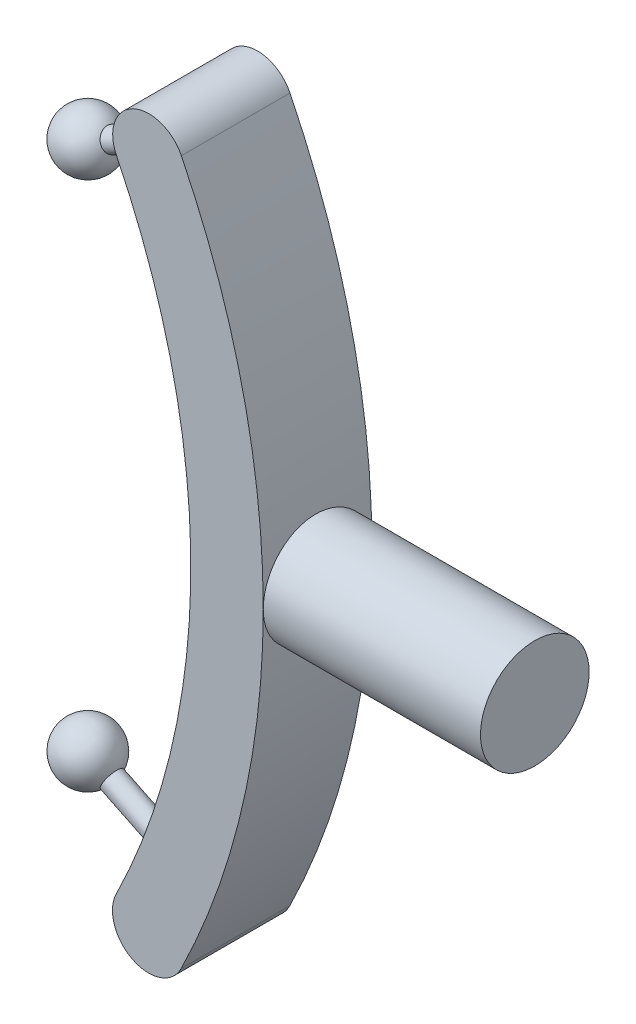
ISO-10303-21;
HEADER;
FILE_DESCRIPTION(('STEP AP214'),'2;1');
FILE_NAME('part.step','',(''),(''),'','','');
FILE_SCHEMA(('AUTOMOTIVE_DESIGN { 1 0 10303 214 1 1 1 1 }'));
ENDSEC;
DATA;
#1=APPLICATION_CONTEXT('core data for automotive mechanical design processes');
#2=APPLICATION_PROTOCOL_DEFINITION('international standard','automotive_design',2000,#1);
#3=PRODUCT_CONTEXT('',#1,'mechanical');
#4=PRODUCT('Part','Part','',(#3));
#5=PRODUCT_RELATED_PRODUCT_CATEGORY('part','',(#4));
#6=PRODUCT_DEFINITION_FORMATION('','',#4);
#7=PRODUCT_DEFINITION_CONTEXT('part definition',#1,'design');
#8=PRODUCT_DEFINITION('design','',#6,#7);
#9=PRODUCT_DEFINITION_SHAPE('','',#8);
#10=(LENGTH_UNIT() NAMED_UNIT(*) SI_UNIT(.MILLI.,.METRE.));
#11=(NAMED_UNIT(*) PLANE_ANGLE_UNIT() SI_UNIT($,.RADIAN.));
#12=(NAMED_UNIT(*) SI_UNIT($,.STERADIAN.) SOLID_ANGLE_UNIT());
#13=UNCERTAINTY_MEASURE_WITH_UNIT(LENGTH_MEASURE(1.E-05),#10,'distance_accuracy_value','');
#14=(GEOMETRIC_REPRESENTATION_CONTEXT(3) GLOBAL_UNCERTAINTY_ASSIGNED_CONTEXT((#13)) GLOBAL_UNIT_ASSIGNED_CONTEXT((#10,
#11,#12)) REPRESENTATION_CONTEXT('',''));
#15=CARTESIAN_POINT('',(0.,0.,0.));
#16=DIRECTION('',(0.,0.,1.));
#17=DIRECTION('',(1.,0.,0.));
#18=AXIS2_PLACEMENT_3D('',#15,#16,#17);
#19=CARTESIAN_POINT('',(120.643673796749,-56.8344794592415,0.));
#20=DIRECTION('',(0.898930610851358,-0.438091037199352,0.));
#21=DIRECTION('',(-0.438091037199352,-0.898930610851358,0.));
#22=AXIS2_PLACEMENT_3D('',#19,#20,#21);
#23=CYLINDRICAL_SURFACE('',#22,1.90500000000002);
#24=CARTESIAN_POINT('',(114.101757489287,-55.7654815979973,0.));
#25=CARTESIAN_POINT('',(114.101759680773,-55.7654773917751,-0.107004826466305));
#26=CARTESIAN_POINT('',(114.105730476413,-55.7573547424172,-0.21408708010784));
#27=CARTESIAN_POINT('',(114.121505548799,-55.7250597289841,-0.425302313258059));
#28=CARTESIAN_POINT('',(114.133319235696,-55.7008680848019,-0.529431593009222));
#29=CARTESIAN_POINT('',(114.164413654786,-55.6371090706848,-0.731650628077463));
#30=CARTESIAN_POINT('',(114.183690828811,-55.5975490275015,-0.829743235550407));
#31=CARTESIAN_POINT('',(114.229114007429,-55.5041637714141,-1.01712055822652));
#32=CARTESIAN_POINT('',(114.255258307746,-55.4503420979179,-1.10640745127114));
#33=CARTESIAN_POINT('',(114.313621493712,-55.3299232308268,-1.27367881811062));
#34=CARTESIAN_POINT('',(114.345840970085,-55.2633247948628,-1.35166219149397));
#35=CARTESIAN_POINT('',(114.415377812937,-55.1192135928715,-1.49410413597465));
#36=CARTESIAN_POINT('',(114.452695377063,-55.0417004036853,-1.55856218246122));
#37=CARTESIAN_POINT('',(114.53130610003,-54.8779387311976,-1.67211672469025));
#38=CARTESIAN_POINT('',(114.572599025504,-54.7916907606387,-1.72121412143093));
#39=CARTESIAN_POINT('',(114.657939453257,-54.6128805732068,-1.80265913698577));
#40=CARTESIAN_POINT('',(114.701986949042,-54.5203183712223,-1.83500679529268));
#41=CARTESIAN_POINT('',(114.791549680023,-54.3314921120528,-1.88203504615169));
#42=CARTESIAN_POINT('',(114.837064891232,-54.235228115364,-1.89671592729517));
#43=CARTESIAN_POINT('',(114.928254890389,-54.0417215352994,-1.90799662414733));
#44=CARTESIAN_POINT('',(114.973929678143,-53.9444789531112,-1.9045964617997));
#45=CARTESIAN_POINT('',(115.064151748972,-53.7517656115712,-1.87981215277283));
#46=CARTESIAN_POINT('',(115.10869890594,-53.6562950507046,-1.85842600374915));
#47=CARTESIAN_POINT('',(115.195420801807,-53.4698569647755,-1.79827551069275));
#48=CARTESIAN_POINT('',(115.237595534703,-53.3788894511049,-1.75951112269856));
#49=CARTESIAN_POINT('',(115.318426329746,-53.2040396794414,-1.66569485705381));
#50=CARTESIAN_POINT('',(115.357081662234,-53.1201588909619,-1.61063961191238));
#51=CARTESIAN_POINT('',(115.429821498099,-52.9619099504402,-1.4858065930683));
#52=CARTESIAN_POINT('',(115.463905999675,-52.887541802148,-1.41602881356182));
#53=CARTESIAN_POINT('',(115.5266001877,-52.7504534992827,-1.26372400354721));
#54=CARTESIAN_POINT('',(115.555209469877,-52.6877342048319,-1.18119603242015));
#55=CARTESIAN_POINT('',(115.60619820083,-52.5757618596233,-1.0057359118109));
#56=CARTESIAN_POINT('',(115.628577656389,-52.526508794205,-0.912803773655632));
#57=CARTESIAN_POINT('',(115.666519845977,-52.4429051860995,-0.719195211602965));
#58=CARTESIAN_POINT('',(115.682084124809,-52.4085512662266,-0.618520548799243));
#59=CARTESIAN_POINT('',(115.706001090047,-52.35572709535,-0.412266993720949));
#60=CARTESIAN_POINT('',(115.714353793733,-52.3372568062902,-0.306688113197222));
#61=CARTESIAN_POINT('',(115.72363101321,-52.3167406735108,-0.0936641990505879));
#62=CARTESIAN_POINT('',(115.724558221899,-52.3146888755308,0.013780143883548));
#63=CARTESIAN_POINT('',(115.718967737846,-52.3270537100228,0.227521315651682));
#64=CARTESIAN_POINT('',(115.712450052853,-52.3414703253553,0.333818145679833));
#65=CARTESIAN_POINT('',(115.692138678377,-52.3863498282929,0.542232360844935));
#66=CARTESIAN_POINT('',(115.678345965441,-52.4168105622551,0.644350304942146));
#67=CARTESIAN_POINT('',(115.643840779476,-52.4928930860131,0.841525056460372));
#68=CARTESIAN_POINT('',(115.623128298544,-52.5385148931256,0.936581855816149));
#69=CARTESIAN_POINT('',(115.575315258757,-52.6436114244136,1.1169609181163));
#70=CARTESIAN_POINT('',(115.548213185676,-52.7030894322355,1.20228086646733));
#71=CARTESIAN_POINT('',(115.488333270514,-52.8341750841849,1.36074191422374));
#72=CARTESIAN_POINT('',(115.455555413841,-52.9057827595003,1.43388298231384));
#73=CARTESIAN_POINT('',(115.385179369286,-53.0590942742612,1.56593718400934));
#74=CARTESIAN_POINT('',(115.347579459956,-53.1408017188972,1.62484521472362));
#75=CARTESIAN_POINT('',(115.268578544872,-53.311946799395,1.72672848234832));
#76=CARTESIAN_POINT('',(115.227177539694,-53.4013844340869,1.76970372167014));
#77=CARTESIAN_POINT('',(115.141697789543,-53.5854431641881,1.83850611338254));
#78=CARTESIAN_POINT('',(115.097618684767,-53.6800649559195,1.86433095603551));
#79=CARTESIAN_POINT('',(115.008010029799,-53.8717813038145,1.89808862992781));
#80=CARTESIAN_POINT('',(114.962480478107,-53.9688758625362,1.90602144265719));
#81=CARTESIAN_POINT('',(114.871261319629,-54.1627621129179,1.90376800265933));
#82=CARTESIAN_POINT('',(114.825571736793,-54.2595538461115,1.89358435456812));
#83=CARTESIAN_POINT('',(114.735335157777,-54.4501054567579,1.85539035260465));
#84=CARTESIAN_POINT('',(114.690788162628,-54.5438653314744,1.82737998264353));
#85=CARTESIAN_POINT('',(114.60414106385,-54.7256886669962,1.75433326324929));
#86=CARTESIAN_POINT('',(114.562040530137,-54.8137531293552,1.70929991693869));
#87=CARTESIAN_POINT('',(114.481522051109,-54.9817223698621,1.60348647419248));
#88=CARTESIAN_POINT('',(114.44310396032,-55.0616274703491,1.54270700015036));
#89=CARTESIAN_POINT('',(114.371103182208,-55.2110282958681,1.407138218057));
#90=CARTESIAN_POINT('',(114.337519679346,-55.2805257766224,1.33235127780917));
#91=CARTESIAN_POINT('',(114.276187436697,-55.4072012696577,1.17085931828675));
#92=CARTESIAN_POINT('',(114.248440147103,-55.4643762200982,1.0841513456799));
#93=CARTESIAN_POINT('',(114.199625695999,-55.5648145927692,0.901260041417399));
#94=CARTESIAN_POINT('',(114.178561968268,-55.6080708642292,0.805071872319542));
#95=CARTESIAN_POINT('',(114.143800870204,-55.6793885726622,0.606058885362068));
#96=CARTESIAN_POINT('',(114.13009468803,-55.7074681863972,0.503242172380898));
#97=CARTESIAN_POINT('',(114.11411968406,-55.7401818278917,0.333143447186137));
#98=CARTESIAN_POINT('',(114.109490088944,-55.7496575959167,0.266965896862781));
#99=CARTESIAN_POINT('',(114.103308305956,-55.7623087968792,0.133869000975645));
#100=CARTESIAN_POINT('',(114.101756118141,-55.7654842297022,0.0669496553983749));
#101=CARTESIAN_POINT('',(114.101757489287,-55.7654815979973,0.));
#102=B_SPLINE_CURVE_WITH_KNOTS('',3,(#24,#25,#26,#27,#28,#29,#30,#31,#32,#33,#34,#35,#36,#37,
#38,#39,#40,#41,#42,#43,#44,#45,#46,#47,#48,#49,#50,#51,#52,#53,#54,#55,#56,#57,#58,#59,#60,#61,
#62,#63,#64,#65,#66,#67,#68,#69,#70,#71,#72,#73,#74,#75,#76,#77,#78,#79,#80,#81,#82,#83,#84,#85,
#86,#87,#88,#89,#90,#91,#92,#93,#94,#95,#96,#97,#98,#99,#100,#101),.UNSPECIFIED.,.T.,.F.,(4,2,2,
2,2,2,2,2,2,2,2,2,2,2,2,2,2,2,2,2,2,2,2,2,2,2,2,2,2,2,2,2,2,2,2,2,2,2,4),(0.,0.320770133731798,
0.641925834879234,0.962928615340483,1.28385180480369,1.60480621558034,1.92577307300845,
2.24672110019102,2.56766837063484,2.88861039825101,3.20955203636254,3.53052940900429,
3.85150759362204,4.17255217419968,4.49359688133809,4.81466528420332,5.13573333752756,
5.45672857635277,5.77772304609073,6.09860110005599,6.41947882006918,6.74031347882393,
7.06114850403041,7.38205963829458,7.70297159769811,8.02399844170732,8.34502523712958,
8.66609525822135,8.98716561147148,9.30818980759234,9.62921429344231,9.95018217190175,
10.2711373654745,10.5920383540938,10.913018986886,11.2341642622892,11.554924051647,
11.7556201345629,11.9563162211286),.UNSPECIFIED.);
#103=CARTESIAN_POINT('',(114.101757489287,-55.7654815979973,0.));
#104=VERTEX_POINT('',#103);
#105=EDGE_CURVE('E177',#104,#104,#102,.T.);
#106=ORIENTED_EDGE('',*,*,#105,.F.);
#107=EDGE_LOOP('',(#106));
#108=FACE_BOUND('',#107,.T.);
#109=CARTESIAN_POINT('',(103.642456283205,-48.5489889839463,0.));
#110=DIRECTION('',(-0.898930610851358,0.438091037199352,0.));
#111=DIRECTION('',(-0.438091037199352,-0.898930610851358,0.));
#112=AXIS2_PLACEMENT_3D('',#109,#110,#111);
#113=CIRCLE('',#112,1.90500000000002);
#114=CARTESIAN_POINT('',(102.80789285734,-50.2614517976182,0.));
#115=VERTEX_POINT('',#114);
#116=EDGE_CURVE('E36',#115,#115,#113,.F.);
#117=ORIENTED_EDGE('',*,*,#116,.T.);
#118=EDGE_LOOP('',(#117));
#119=FACE_BOUND('',#118,.T.);
#120=ADVANCED_FACE('F32',(#108,#119),#23,.T.);
#121=CARTESIAN_POINT('',(120.643673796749,56.8344794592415,0.));
#122=DIRECTION('',(0.898930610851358,0.438091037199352,0.));
#123=DIRECTION('',(-0.438091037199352,0.898930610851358,0.));
#124=AXIS2_PLACEMENT_3D('',#121,#122,#123);
#125=CYLINDRICAL_SURFACE('',#124,1.90500000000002);
#126=CARTESIAN_POINT('',(114.101757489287,55.7654815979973,0.));
#127=CARTESIAN_POINT('',(114.101759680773,55.7654773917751,0.107004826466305));
#128=CARTESIAN_POINT('',(114.105730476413,55.7573547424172,0.21408708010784));
#129=CARTESIAN_POINT('',(114.121505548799,55.7250597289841,0.425302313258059));
#130=CARTESIAN_POINT('',(114.133319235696,55.7008680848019,0.529431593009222));
#131=CARTESIAN_POINT('',(114.164413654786,55.6371090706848,0.731650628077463));
#132=CARTESIAN_POINT('',(114.183690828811,55.5975490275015,0.829743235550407));
#133=CARTESIAN_POINT('',(114.229114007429,55.5041637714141,1.01712055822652));
#134=CARTESIAN_POINT('',(114.255258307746,55.4503420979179,1.10640745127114));
#135=CARTESIAN_POINT('',(114.313621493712,55.3299232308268,1.27367881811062));
#136=CARTESIAN_POINT('',(114.345840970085,55.2633247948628,1.35166219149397));
#137=CARTESIAN_POINT('',(114.415377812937,55.1192135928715,1.49410413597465));
#138=CARTESIAN_POINT('',(114.452695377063,55.0417004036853,1.55856218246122));
#139=CARTESIAN_POINT('',(114.53130610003,54.8779387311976,1.67211672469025));
#140=CARTESIAN_POINT('',(114.572599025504,54.7916907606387,1.72121412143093));
#141=CARTESIAN_POINT('',(114.657939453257,54.6128805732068,1.80265913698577));
#142=CARTESIAN_POINT('',(114.701986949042,54.5203183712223,1.83500679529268));
#143=CARTESIAN_POINT('',(114.791549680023,54.3314921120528,1.88203504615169));
#144=CARTESIAN_POINT('',(114.837064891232,54.235228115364,1.89671592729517));
#145=CARTESIAN_POINT('',(114.928254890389,54.0417215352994,1.90799662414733));
#146=CARTESIAN_POINT('',(114.973929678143,53.9444789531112,1.9045964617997));
#147=CARTESIAN_POINT('',(115.064151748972,53.7517656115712,1.87981215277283));
#148=CARTESIAN_POINT('',(115.10869890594,53.6562950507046,1.85842600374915));
#149=CARTESIAN_POINT('',(115.195420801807,53.4698569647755,1.79827551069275));
#150=CARTESIAN_POINT('',(115.237595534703,53.3788894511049,1.75951112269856));
#151=CARTESIAN_POINT('',(115.318426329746,53.2040396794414,1.66569485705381));
#152=CARTESIAN_POINT('',(115.357081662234,53.1201588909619,1.61063961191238));
#153=CARTESIAN_POINT('',(115.429821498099,52.9619099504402,1.4858065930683));
#154=CARTESIAN_POINT('',(115.463905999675,52.887541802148,1.41602881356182));
#155=CARTESIAN_POINT('',(115.5266001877,52.7504534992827,1.26372400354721));
#156=CARTESIAN_POINT('',(115.555209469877,52.6877342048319,1.18119603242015));
#157=CARTESIAN_POINT('',(115.60619820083,52.5757618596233,1.0057359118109));
#158=CARTESIAN_POINT('',(115.628577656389,52.526508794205,0.912803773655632));
#159=CARTESIAN_POINT('',(115.666519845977,52.4429051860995,0.719195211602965));
#160=CARTESIAN_POINT('',(115.682084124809,52.4085512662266,0.618520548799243));
#161=CARTESIAN_POINT('',(115.706001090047,52.35572709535,0.412266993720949));
#162=CARTESIAN_POINT('',(115.714353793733,52.3372568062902,0.306688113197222));
#163=CARTESIAN_POINT('',(115.72363101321,52.3167406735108,0.0936641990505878));
#164=CARTESIAN_POINT('',(115.724558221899,52.3146888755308,-0.013780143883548));
#165=CARTESIAN_POINT('',(115.718967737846,52.3270537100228,-0.227521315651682));
#166=CARTESIAN_POINT('',(115.712450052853,52.3414703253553,-0.333818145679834));
#167=CARTESIAN_POINT('',(115.692138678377,52.3863498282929,-0.542232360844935));
#168=CARTESIAN_POINT('',(115.678345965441,52.4168105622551,-0.644350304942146));
#169=CARTESIAN_POINT('',(115.643840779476,52.4928930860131,-0.841525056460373));
#170=CARTESIAN_POINT('',(115.623128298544,52.5385148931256,-0.936581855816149));
#171=CARTESIAN_POINT('',(115.575315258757,52.6436114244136,-1.1169609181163));
#172=CARTESIAN_POINT('',(115.548213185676,52.7030894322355,-1.20228086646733));
#173=CARTESIAN_POINT('',(115.488333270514,52.8341750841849,-1.36074191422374));
#174=CARTESIAN_POINT('',(115.455555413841,52.9057827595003,-1.43388298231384));
#175=CARTESIAN_POINT('',(115.385179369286,53.0590942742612,-1.56593718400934));
#176=CARTESIAN_POINT('',(115.347579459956,53.1408017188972,-1.62484521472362));
#177=CARTESIAN_POINT('',(115.268578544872,53.311946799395,-1.72672848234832));
#178=CARTESIAN_POINT('',(115.227177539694,53.4013844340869,-1.76970372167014));
#179=CARTESIAN_POINT('',(115.141697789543,53.5854431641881,-1.83850611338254));
#180=CARTESIAN_POINT('',(115.097618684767,53.6800649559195,-1.86433095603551));
#181=CARTESIAN_POINT('',(115.008010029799,53.8717813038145,-1.89808862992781));
#182=CARTESIAN_POINT('',(114.962480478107,53.9688758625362,-1.90602144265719));
#183=CARTESIAN_POINT('',(114.871261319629,54.1627621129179,-1.90376800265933));
#184=CARTESIAN_POINT('',(114.825571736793,54.2595538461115,-1.89358435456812));
#185=CARTESIAN_POINT('',(114.735335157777,54.4501054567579,-1.85539035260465));
#186=CARTESIAN_POINT('',(114.690788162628,54.5438653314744,-1.82737998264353));
#187=CARTESIAN_POINT('',(114.60414106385,54.7256886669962,-1.75433326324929));
#188=CARTESIAN_POINT('',(114.562040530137,54.8137531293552,-1.70929991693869));
#189=CARTESIAN_POINT('',(114.481522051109,54.9817223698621,-1.60348647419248));
#190=CARTESIAN_POINT('',(114.44310396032,55.0616274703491,-1.54270700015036));
#191=CARTESIAN_POINT('',(114.371103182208,55.2110282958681,-1.407138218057));
#192=CARTESIAN_POINT('',(114.337519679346,55.2805257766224,-1.33235127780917));
#193=CARTESIAN_POINT('',(114.276187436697,55.4072012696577,-1.17085931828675));
#194=CARTESIAN_POINT('',(114.248440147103,55.4643762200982,-1.0841513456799));
#195=CARTESIAN_POINT('',(114.199625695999,55.5648145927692,-0.901260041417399));
#196=CARTESIAN_POINT('',(114.178561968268,55.6080708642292,-0.805071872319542));
#197=CARTESIAN_POINT('',(114.143800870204,55.6793885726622,-0.606058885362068));
#198=CARTESIAN_POINT('',(114.13009468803,55.7074681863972,-0.503242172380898));
#199=CARTESIAN_POINT('',(114.11411968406,55.7401818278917,-0.333143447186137));
#200=CARTESIAN_POINT('',(114.109490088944,55.7496575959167,-0.266965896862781));
#201=CARTESIAN_POINT('',(114.103308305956,55.7623087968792,-0.133869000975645));
#202=CARTESIAN_POINT('',(114.101756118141,55.7654842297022,-0.0669496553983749));
#203=CARTESIAN_POINT('',(114.101757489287,55.7654815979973,0.));
#204=B_SPLINE_CURVE_WITH_KNOTS('',3,(#126,#127,#128,#129,#130,#131,#132,#133,#134,#135,#136,
#137,#138,#139,#140,#141,#142,#143,#144,#145,#146,#147,#148,#149,#150,#151,#152,#153,#154,#155,
#156,#157,#158,#159,#160,#161,#162,#163,#164,#165,#166,#167,#168,#169,#170,#171,#172,#173,#174,
#175,#176,#177,#178,#179,#180,#181,#182,#183,#184,#185,#186,#187,#188,#189,#190,#191,#192,#193,
#194,#195,#196,#197,#198,#199,#200,#201,#202,#203),.UNSPECIFIED.,.T.,.F.,(4,2,2,2,2,2,2,2,2,2,2,
2,2,2,2,2,2,2,2,2,2,2,2,2,2,2,2,2,2,2,2,2,2,2,2,2,2,2,4),(0.,0.320770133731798,
0.641925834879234,0.962928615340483,1.28385180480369,1.60480621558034,1.92577307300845,
2.24672110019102,2.56766837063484,2.88861039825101,3.20955203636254,3.53052940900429,
3.85150759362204,4.17255217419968,4.49359688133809,4.81466528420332,5.13573333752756,
5.45672857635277,5.77772304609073,6.09860110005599,6.41947882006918,6.74031347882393,
7.06114850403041,7.38205963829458,7.70297159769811,8.02399844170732,8.34502523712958,
8.66609525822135,8.98716561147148,9.30818980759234,9.62921429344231,9.95018217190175,
10.2711373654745,10.5920383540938,10.913018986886,11.2341642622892,11.554924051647,
11.7556201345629,11.9563162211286),.UNSPECIFIED.);
#205=CARTESIAN_POINT('',(114.101757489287,55.7654815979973,0.));
#206=VERTEX_POINT('',#205);
#207=EDGE_CURVE('E125',#206,#206,#204,.T.);
#208=ORIENTED_EDGE('',*,*,#207,.F.);
#209=EDGE_LOOP('',(#208));
#210=FACE_BOUND('',#209,.T.);
#211=CARTESIAN_POINT('',(103.642456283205,48.5489889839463,0.));
#212=DIRECTION('',(-0.898930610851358,-0.438091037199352,0.));
#213=DIRECTION('',(0.438091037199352,-0.898930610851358,0.));
#214=AXIS2_PLACEMENT_3D('',#211,#212,#213);
#215=CIRCLE('',#214,1.90500000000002);
#216=CARTESIAN_POINT('',(104.477019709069,46.8365261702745,0.));
#217=VERTEX_POINT('',#216);
#218=EDGE_CURVE('E133',#217,#217,#215,.F.);
#219=ORIENTED_EDGE('',*,*,#218,.T.);
#220=EDGE_LOOP('',(#219));
#221=FACE_BOUND('',#220,.T.);
#222=ADVANCED_FACE('F138',(#210,#221),#125,.T.);
#223=CARTESIAN_POINT('',(5.32907051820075E-12,2.66453525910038E-12,9.525));
#224=DIRECTION('',(0.,0.,-1.));
#225=DIRECTION('',(-1.,0.,0.));
#226=AXIS2_PLACEMENT_3D('',#223,#224,#225);
#227=CYLINDRICAL_SURFACE('',#226,139.7);
#228=CARTESIAN_POINT('',(5.32907051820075E-12,2.66453525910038E-12,-9.525));
#229=DIRECTION('',(0.,0.,1.));
#230=DIRECTION('',(1.,0.,0.));
#231=AXIS2_PLACEMENT_3D('',#228,#229,#230);
#232=CIRCLE('',#231,139.7);
#233=CARTESIAN_POINT('',(125.300313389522,-61.7731451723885,-9.525));
#234=VERTEX_POINT('',#233);
#235=CARTESIAN_POINT('',(139.700000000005,0.,-9.525));
#236=VERTEX_POINT('',#235);
#237=EDGE_CURVE('E96',#234,#236,#232,.T.);
#238=ORIENTED_EDGE('',*,*,#237,.T.);
#239=CARTESIAN_POINT('',(139.700000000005,0.,-9.52500000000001));
#240=CARTESIAN_POINT('',(139.700000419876,-0.26727418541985,-9.52500223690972));
#241=CARTESIAN_POINT('',(139.699231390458,-0.534512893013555,-9.51374586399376));
#242=CARTESIAN_POINT('',(139.696177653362,-1.0671753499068,-9.46880124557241));
#243=CARTESIAN_POINT('',(139.693892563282,-1.33259862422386,-9.4351073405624));
#244=CARTESIAN_POINT('',(139.68786744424,-1.85992001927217,-9.34547637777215));
#245=CARTESIAN_POINT('',(139.68412593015,-2.12181425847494,-9.28951661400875));
#246=CARTESIAN_POINT('',(139.675294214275,-2.63994766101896,-9.15575712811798));
#247=CARTESIAN_POINT('',(139.670203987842,-2.89618672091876,-9.07795700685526));
#248=CARTESIAN_POINT('',(139.658822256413,-3.40104262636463,-8.90112535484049));
#249=CARTESIAN_POINT('',(139.652531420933,-3.64966363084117,-8.8021056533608));
#250=CARTESIAN_POINT('',(139.638924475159,-4.13767631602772,-8.58351589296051));
#251=CARTESIAN_POINT('',(139.631608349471,-4.37706785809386,-8.46394552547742));
#252=CARTESIAN_POINT('',(139.616159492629,-4.84487094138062,-8.20513797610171));
#253=CARTESIAN_POINT('',(139.608026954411,-5.0732850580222,-8.06590543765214));
#254=CARTESIAN_POINT('',(139.591173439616,-5.51758361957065,-7.76874014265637));
#255=CARTESIAN_POINT('',(139.582452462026,-5.73346804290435,-7.61080735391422));
#256=CARTESIAN_POINT('',(139.564654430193,-6.15151045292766,-7.27710003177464));
#257=CARTESIAN_POINT('',(139.555576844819,-6.35364663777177,-7.10129821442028));
#258=CARTESIAN_POINT('',(139.537335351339,-6.74239711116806,-6.73330109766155));
#259=CARTESIAN_POINT('',(139.528171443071,-6.92901137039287,-6.54110576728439));
#260=CARTESIAN_POINT('',(139.510016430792,-7.28540766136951,-6.14166962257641));
#261=CARTESIAN_POINT('',(139.501025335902,-7.45518880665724,-5.93442801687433));
#262=CARTESIAN_POINT('',(139.483471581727,-7.77670141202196,-5.50637704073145));
#263=CARTESIAN_POINT('',(139.474908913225,-7.92843326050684,-5.28556796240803));
#264=CARTESIAN_POINT('',(139.458446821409,-8.21291298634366,-4.83171632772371));
#265=CARTESIAN_POINT('',(139.450548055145,-8.34564214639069,-4.59866201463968));
#266=CARTESIAN_POINT('',(139.435648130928,-8.59099201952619,-4.12217069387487));
#267=CARTESIAN_POINT('',(139.428646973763,-8.70361271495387,-3.87873367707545));
#268=CARTESIAN_POINT('',(139.41574208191,-8.90793725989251,-3.38320872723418));
#269=CARTESIAN_POINT('',(139.409838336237,-8.99964131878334,-3.13112088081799));
#270=CARTESIAN_POINT('',(139.399296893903,-9.16147407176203,-2.62008662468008));
#271=CARTESIAN_POINT('',(139.394659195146,-9.23160280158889,-2.36114022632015));
#272=CARTESIAN_POINT('',(139.386788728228,-9.34968600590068,-1.8386462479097));
#273=CARTESIAN_POINT('',(139.383553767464,-9.39767509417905,-1.57510652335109));
#274=CARTESIAN_POINT('',(139.378570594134,-9.47129470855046,-1.04490847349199));
#275=CARTESIAN_POINT('',(139.376822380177,-9.49692525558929,-0.778250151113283));
#276=CARTESIAN_POINT('',(139.374862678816,-9.52564232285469,-0.24371986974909));
#277=CARTESIAN_POINT('',(139.374651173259,-9.52872910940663,0.0241520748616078));
#278=CARTESIAN_POINT('',(139.375770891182,-9.51233700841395,0.559201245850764));
#279=CARTESIAN_POINT('',(139.377102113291,-9.49285814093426,0.82637847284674));
#280=CARTESIAN_POINT('',(139.381265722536,-9.43152722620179,1.35768624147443));
#281=CARTESIAN_POINT('',(139.384095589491,-9.3897127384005,1.6218211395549));
#282=CARTESIAN_POINT('',(139.39117435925,-9.28403527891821,2.14562295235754));
#283=CARTESIAN_POINT('',(139.395423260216,-9.22017233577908,2.40528987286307));
#284=CARTESIAN_POINT('',(139.405219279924,-9.07085605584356,2.91831608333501));
#285=CARTESIAN_POINT('',(139.410766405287,-8.98540260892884,3.17167534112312));
#286=CARTESIAN_POINT('',(139.423001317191,-8.79351686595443,3.67029238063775));
#287=CARTESIAN_POINT('',(139.429689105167,-8.68708454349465,3.91555015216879));
#288=CARTESIAN_POINT('',(139.444020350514,-8.45392401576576,4.39638858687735));
#289=CARTESIAN_POINT('',(139.451664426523,-8.32718265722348,4.63196285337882));
#290=CARTESIAN_POINT('',(139.467691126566,-8.05430377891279,5.09168883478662));
#291=CARTESIAN_POINT('',(139.476074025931,-7.90815901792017,5.31583624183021));
#292=CARTESIAN_POINT('',(139.493334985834,-7.59760880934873,5.75094577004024));
#293=CARTESIAN_POINT('',(139.502212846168,-7.43321071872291,5.96191315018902));
#294=CARTESIAN_POINT('',(139.520219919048,-7.0871891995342,6.36936765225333));
#295=CARTESIAN_POINT('',(139.529349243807,-6.90555798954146,6.56584816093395));
#296=CARTESIAN_POINT('',(139.547616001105,-6.5260267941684,6.94322399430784));
#297=CARTESIAN_POINT('',(139.556753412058,-6.32809430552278,7.12408663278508));
#298=CARTESIAN_POINT('',(139.574754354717,-5.91777732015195,7.46841583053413));
#299=CARTESIAN_POINT('',(139.583618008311,-5.70539939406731,7.63189021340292));
#300=CARTESIAN_POINT('',(139.600828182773,-5.26752205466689,7.94044085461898));
#301=CARTESIAN_POINT('',(139.609174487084,-5.04201722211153,8.08550943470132));
#302=CARTESIAN_POINT('',(139.625106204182,-4.5796503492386,8.356084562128));
#303=CARTESIAN_POINT('',(139.632691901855,-4.34279261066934,8.4815984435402));
#304=CARTESIAN_POINT('',(139.646892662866,-3.85925867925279,8.71226251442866));
#305=CARTESIAN_POINT('',(139.653507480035,-3.61258001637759,8.81740754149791));
#306=CARTESIAN_POINT('',(139.665576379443,-3.11121295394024,9.00654005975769));
#307=CARTESIAN_POINT('',(139.671030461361,-2.85652455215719,9.09052754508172));
#308=CARTESIAN_POINT('',(139.680622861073,-2.34095426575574,9.23673940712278));
#309=CARTESIAN_POINT('',(139.684761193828,-2.0800724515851,9.29896403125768));
#310=CARTESIAN_POINT('',(139.691604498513,-1.55397385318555,9.40120194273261));
#311=CARTESIAN_POINT('',(139.694309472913,-1.28875707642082,9.44121526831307));
#312=CARTESIAN_POINT('',(139.69820520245,-0.756418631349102,9.49868326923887));
#313=CARTESIAN_POINT('',(139.699398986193,-0.489301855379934,9.51618306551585));
#314=CARTESIAN_POINT('',(139.700248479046,0.0454591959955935,9.52864572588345));
#315=CARTESIAN_POINT('',(139.699904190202,0.313103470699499,9.52360861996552));
#316=CARTESIAN_POINT('',(139.697687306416,0.847011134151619,9.49103400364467));
#317=CARTESIAN_POINT('',(139.695814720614,1.11327453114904,9.46349662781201));
#318=CARTESIAN_POINT('',(139.690594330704,1.64252615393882,9.38612041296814));
#319=CARTESIAN_POINT('',(139.687246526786,1.9055143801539,9.3362815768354));
#320=CARTESIAN_POINT('',(139.679174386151,2.42609806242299,9.21471930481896));
#321=CARTESIAN_POINT('',(139.674451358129,2.68369839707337,9.14301667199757));
#322=CARTESIAN_POINT('',(139.66376102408,3.19193800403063,8.97822492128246));
#323=CARTESIAN_POINT('',(139.657793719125,3.4425772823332,8.88513582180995));
#324=CARTESIAN_POINT('',(139.644784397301,3.93508207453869,8.67825344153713));
#325=CARTESIAN_POINT('',(139.637742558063,4.17694903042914,8.56446358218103));
#326=CARTESIAN_POINT('',(139.62277945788,4.65032933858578,8.31693614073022));
#327=CARTESIAN_POINT('',(139.614857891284,4.88183905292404,8.1831916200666));
#328=CARTESIAN_POINT('',(139.598349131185,5.33310217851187,7.8965308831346));
#329=CARTESIAN_POINT('',(139.589761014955,5.552838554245,7.74358790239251));
#330=CARTESIAN_POINT('',(139.572171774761,5.97865229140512,7.41976327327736));
#331=CARTESIAN_POINT('',(139.56317065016,6.18472963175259,7.24888159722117));
#332=CARTESIAN_POINT('',(139.54500823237,6.58180792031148,6.89035526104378));
#333=CARTESIAN_POINT('',(139.535846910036,6.77280608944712,6.70270752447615));
#334=CARTESIAN_POINT('',(139.517628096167,7.13827176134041,6.31206919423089));
#335=CARTESIAN_POINT('',(139.508570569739,7.31274497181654,6.10908394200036));
#336=CARTESIAN_POINT('',(139.490796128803,7.64430627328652,5.68875985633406));
#337=CARTESIAN_POINT('',(139.482079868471,7.80136193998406,5.47139541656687));
#338=CARTESIAN_POINT('',(139.465253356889,8.096602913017,5.02418525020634));
#339=CARTESIAN_POINT('',(139.457143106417,8.2347881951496,4.79433950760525));
#340=CARTESIAN_POINT('',(139.441759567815,8.49130182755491,4.32379695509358));
#341=CARTESIAN_POINT('',(139.434486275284,8.60963028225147,4.08310020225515));
#342=CARTESIAN_POINT('',(139.420984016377,8.82558375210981,3.59256338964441));
#343=CARTESIAN_POINT('',(139.414755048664,8.92320879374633,3.34272334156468));
#344=CARTESIAN_POINT('',(139.403524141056,9.09697959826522,2.83589384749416));
#345=CARTESIAN_POINT('',(139.39852115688,9.17314364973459,2.57891069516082));
#346=CARTESIAN_POINT('',(139.389878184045,9.30355499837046,2.05941950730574));
#347=CARTESIAN_POINT('',(139.386238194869,9.35780230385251,1.79691147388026));
#348=CARTESIAN_POINT('',(139.380425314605,9.44398793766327,1.26824491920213));
#349=CARTESIAN_POINT('',(139.37825240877,9.47592649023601,1.00208643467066));
#350=CARTESIAN_POINT('',(139.375435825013,9.517264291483,0.468016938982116));
#351=CARTESIAN_POINT('',(139.374792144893,9.5266635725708,0.2001059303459));
#352=CARTESIAN_POINT('',(139.375052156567,9.52285878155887,-0.335007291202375));
#353=CARTESIAN_POINT('',(139.375952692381,9.50970081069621,-0.602209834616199));
#354=CARTESIAN_POINT('',(139.379269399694,9.46096487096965,-1.1345525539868));
#355=CARTESIAN_POINT('',(139.381685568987,9.42538693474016,-1.39969273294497));
#356=CARTESIAN_POINT('',(139.387964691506,9.33206742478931,-1.92602612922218));
#357=CARTESIAN_POINT('',(139.391827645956,9.27432583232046,-2.18721934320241));
#358=CARTESIAN_POINT('',(139.400890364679,9.1370941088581,-2.70380465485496));
#359=CARTESIAN_POINT('',(139.406090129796,9.05760396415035,-2.95919674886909));
#360=CARTESIAN_POINT('',(139.417677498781,8.877462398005,-3.46232134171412));
#361=CARTESIAN_POINT('',(139.424064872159,8.77681508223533,-3.71005531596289));
#362=CARTESIAN_POINT('',(139.437849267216,8.55502967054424,-4.19624960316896));
#363=CARTESIAN_POINT('',(139.445246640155,8.4338844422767,-4.4347066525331));
#364=CARTESIAN_POINT('',(139.460838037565,8.17201602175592,-4.90052605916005));
#365=CARTESIAN_POINT('',(139.469031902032,8.03129675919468,-5.12789063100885));
#366=CARTESIAN_POINT('',(139.485985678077,7.73125909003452,-5.56997518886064));
#367=CARTESIAN_POINT('',(139.494745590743,7.57194064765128,-5.78469515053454));
#368=CARTESIAN_POINT('',(139.512602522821,7.23547974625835,-6.20041234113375));
#369=CARTESIAN_POINT('',(139.521700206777,7.05830083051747,-6.40138003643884));
#370=CARTESIAN_POINT('',(139.53995456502,6.6877108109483,-6.78761780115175));
#371=CARTESIAN_POINT('',(139.549111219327,6.49430496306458,-6.97289291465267));
#372=CARTESIAN_POINT('',(139.567230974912,6.09249447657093,-7.32658189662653));
#373=CARTESIAN_POINT('',(139.576193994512,5.88408366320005,-7.49498875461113));
#374=CARTESIAN_POINT('',(139.593668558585,5.45381041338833,-7.81365775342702));
#375=CARTESIAN_POINT('',(139.602180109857,5.23194817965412,-7.96392016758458));
#376=CARTESIAN_POINT('',(139.618522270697,4.77601675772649,-8.24543324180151));
#377=CARTESIAN_POINT('',(139.626351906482,4.54193085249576,-8.37665688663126));
#378=CARTESIAN_POINT('',(139.641094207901,4.06350584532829,-8.61890015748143));
#379=CARTESIAN_POINT('',(139.648006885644,3.81916687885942,-8.72992005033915));
#380=CARTESIAN_POINT('',(139.660712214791,3.32222199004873,-8.93085754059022));
#381=CARTESIAN_POINT('',(139.666506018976,3.06962489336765,-9.02079687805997));
#382=CARTESIAN_POINT('',(139.676816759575,2.55780960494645,-9.17905149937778));
#383=CARTESIAN_POINT('',(139.681334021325,2.29859311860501,-9.24737229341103));
#384=CARTESIAN_POINT('',(139.690021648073,1.70275943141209,-9.3778031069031));
#385=CARTESIAN_POINT('',(139.693749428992,1.36458906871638,-9.43295227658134));
#386=CARTESIAN_POINT('',(139.69873833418,0.684259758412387,-9.5065492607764));
#387=CARTESIAN_POINT('',(139.699999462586,0.342100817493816,-9.52499713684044));
#388=CARTESIAN_POINT('',(139.700000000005,0.,-9.52500000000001));
#389=B_SPLINE_CURVE_WITH_KNOTS('',3,(#239,#240,#241,#242,#243,#244,#245,#246,#247,#248,#249,
#250,#251,#252,#253,#254,#255,#256,#257,#258,#259,#260,#261,#262,#263,#264,#265,#266,#267,#268,
#269,#270,#271,#272,#273,#274,#275,#276,#277,#278,#279,#280,#281,#282,#283,#284,#285,#286,#287,
#288,#289,#290,#291,#292,#293,#294,#295,#296,#297,#298,#299,#300,#301,#302,#303,#304,#305,#306,
#307,#308,#309,#310,#311,#312,#313,#314,#315,#316,#317,#318,#319,#320,#321,#322,#323,#324,#325,
#326,#327,#328,#329,#330,#331,#332,#333,#334,#335,#336,#337,#338,#339,#340,#341,#342,#343,#344,
#345,#346,#347,#348,#349,#350,#351,#352,#353,#354,#355,#356,#357,#358,#359,#360,#361,#362,#363,
#364,#365,#366,#367,#368,#369,#370,#371,#372,#373,#374,#375,#376,#377,#378,#379,#380,#381,#382,
#383,#384,#385,#386,#387,#388),.UNSPECIFIED.,.T.,.F.,(4,2,2,2,2,2,2,2,2,2,2,2,2,2,2,2,2,2,2,2,2,
2,2,2,2,2,2,2,2,2,2,2,2,2,2,2,2,2,2,2,2,2,2,2,2,2,2,2,2,2,2,2,2,2,2,2,2,2,2,2,2,2,2,2,2,2,2,2,2,
2,2,2,2,2,4),(0.,0.801523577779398,1.60324940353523,2.40579490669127,3.20835507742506,
4.01046900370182,4.81259497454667,5.6145318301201,6.41647006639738,7.21965170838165,
8.02283486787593,8.8260603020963,9.62926844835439,10.4332623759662,11.237257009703,
12.0412435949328,12.8452288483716,13.6479528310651,14.4506760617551,15.253389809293,
16.0561028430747,16.8574702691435,17.65883665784,18.4602071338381,19.2615786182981,
20.0634712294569,20.8656639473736,21.6675345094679,22.4697688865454,23.2736434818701,
24.0771548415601,24.8810003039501,25.6845435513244,26.4882901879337,27.2920370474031,
28.0957747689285,28.8995111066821,29.7016340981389,30.503756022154,31.3058731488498,
32.1079901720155,32.9093463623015,33.710701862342,34.5119250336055,35.3134274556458,
36.1160599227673,36.9186936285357,37.7214749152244,38.5239779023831,39.3279505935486,
40.1319243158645,40.9358938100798,41.7398622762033,42.543143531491,43.3464244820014,
44.1496973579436,44.9529690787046,45.7546010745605,46.5562319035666,47.3578634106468,
48.1594954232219,48.9609720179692,49.7627280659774,50.5643233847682,51.365920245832,
52.1691877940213,52.972196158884,53.7755368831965,54.5788655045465,55.3833230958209,
56.1877700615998,56.9913837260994,57.7947923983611,58.8207138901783,59.8466336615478),.UNSPECIFIED.);
#390=CARTESIAN_POINT('',(139.700000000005,0.,9.52500000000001));
#391=VERTEX_POINT('',#390);
#392=EDGE_CURVE('E48',#236,#391,#389,.T.);
#393=ORIENTED_EDGE('',*,*,#392,.T.);
#394=CARTESIAN_POINT('',(3.5527136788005E-12,0.,9.525));
#395=DIRECTION('',(0.,0.,1.));
#396=DIRECTION('',(1.,0.,0.));
#397=AXIS2_PLACEMENT_3D('',#394,#395,#396);
#398=CIRCLE('',#397,139.700000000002);
#399=CARTESIAN_POINT('',(125.300313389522,-61.7731451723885,9.525));
#400=VERTEX_POINT('',#399);
#401=EDGE_CURVE('E84',#400,#391,#398,.T.);
#402=ORIENTED_EDGE('',*,*,#401,.F.);
#403=DIRECTION('',(0.,0.,-1.));
#404=VECTOR('',#403,1.);
#405=CARTESIAN_POINT('',(125.300313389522,-61.7731451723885,9.525));
#406=LINE('',#405,#404);
#407=EDGE_CURVE('E11',#400,#234,#406,.T.);
#408=ORIENTED_EDGE('',*,*,#407,.T.);
#409=EDGE_LOOP('',(#238,#393,#402,#408));
#410=FACE_BOUND('',#409,.T.);
#411=ADVANCED_FACE('F95',(#410),#227,.T.);
#412=CARTESIAN_POINT('',(119.604844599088,-58.9652749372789,9.525));
#413=DIRECTION('',(0.,0.,-1.));
#414=DIRECTION('',(-1.,0.,0.));
#415=AXIS2_PLACEMENT_3D('',#412,#413,#414);
#416=CYLINDRICAL_SURFACE('',#415,6.35000000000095);
#417=CARTESIAN_POINT('',(119.604844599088,-58.9652749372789,-9.525));
#418=DIRECTION('',(0.,0.,1.));
#419=DIRECTION('',(1.,0.,0.));
#420=AXIS2_PLACEMENT_3D('',#417,#418,#419);
#421=CIRCLE('',#420,6.35000000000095);
#422=CARTESIAN_POINT('',(113.909375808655,-56.1574047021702,-9.525));
#423=VERTEX_POINT('',#422);
#424=EDGE_CURVE('E97',#423,#234,#421,.T.);
#425=ORIENTED_EDGE('',*,*,#424,.T.);
#426=ORIENTED_EDGE('',*,*,#407,.F.);
#427=CARTESIAN_POINT('',(119.604844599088,-58.9652749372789,9.525));
#428=DIRECTION('',(0.,0.,1.));
#429=DIRECTION('',(1.,0.,0.));
#430=AXIS2_PLACEMENT_3D('',#427,#428,#429);
#431=CIRCLE('',#430,6.35000000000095);
#432=CARTESIAN_POINT('',(113.909375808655,-56.1574047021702,9.525));
#433=VERTEX_POINT('',#432);
#434=EDGE_CURVE('E103',#433,#400,#431,.T.);
#435=ORIENTED_EDGE('',*,*,#434,.F.);
#436=DIRECTION('',(0.,0.,-1.));
#437=VECTOR('',#436,1.);
#438=CARTESIAN_POINT('',(113.909375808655,-56.1574047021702,9.525));
#439=LINE('',#438,#437);
#440=EDGE_CURVE('E113',#433,#423,#439,.T.);
#441=ORIENTED_EDGE('',*,*,#440,.T.);
#442=EDGE_LOOP('',(#425,#426,#435,#441));
#443=FACE_BOUND('',#442,.T.);
#444=ADVANCED_FACE('F34',(#443),#416,.T.);
#445=CARTESIAN_POINT('',(125.338789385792,61.6950393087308,9.525));
#446=VERTEX_POINT('',#445);
#447=EDGE_CURVE('E99',#391,#446,#398,.T.);
#448=ORIENTED_EDGE('',*,*,#447,.F.);
#449=EDGE_CURVE('E87',#391,#236,#389,.T.);
#450=ORIENTED_EDGE('',*,*,#449,.T.);
#451=CARTESIAN_POINT('',(125.338789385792,61.6950393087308,-9.525));
#452=VERTEX_POINT('',#451);
#453=EDGE_CURVE('E116',#236,#452,#232,.T.);
#454=ORIENTED_EDGE('',*,*,#453,.T.);
#455=DIRECTION('',(0.,0.,-1.));
#456=VECTOR('',#455,1.);
#457=CARTESIAN_POINT('',(125.338789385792,61.6950393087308,9.525));
#458=LINE('',#457,#456);
#459=EDGE_CURVE('E41',#446,#452,#458,.T.);
#460=ORIENTED_EDGE('',*,*,#459,.F.);
#461=EDGE_LOOP('',(#448,#450,#454,#460));
#462=FACE_BOUND('',#461,.T.);
#463=ADVANCED_FACE('F100',(#462),#227,.T.);
#464=CARTESIAN_POINT('',(119.641571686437,58.8907193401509,9.525));
#465=DIRECTION('',(0.,0.,-1.));
#466=DIRECTION('',(-1.,0.,0.));
#467=AXIS2_PLACEMENT_3D('',#464,#465,#466);
#468=CYLINDRICAL_SURFACE('',#467,6.3500000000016);
#469=CARTESIAN_POINT('',(119.641571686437,58.8907193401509,-9.525));
#470=DIRECTION('',(0.,0.,1.));
#471=DIRECTION('',(1.,0.,0.));
#472=AXIS2_PLACEMENT_3D('',#469,#470,#471);
#473=CIRCLE('',#472,6.3500000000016);
#474=CARTESIAN_POINT('',(113.944353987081,56.0863993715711,-9.525));
#475=VERTEX_POINT('',#474);
#476=EDGE_CURVE('E118',#452,#475,#473,.T.);
#477=ORIENTED_EDGE('',*,*,#476,.T.);
#478=DIRECTION('',(0.,0.,-1.));
#479=VECTOR('',#478,1.);
#480=CARTESIAN_POINT('',(113.944353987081,56.0863993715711,9.525));
#481=LINE('',#480,#479);
#482=CARTESIAN_POINT('',(113.944353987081,56.0863993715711,9.525));
#483=VERTEX_POINT('',#482);
#484=EDGE_CURVE('E122',#483,#475,#481,.T.);
#485=ORIENTED_EDGE('',*,*,#484,.F.);
#486=CARTESIAN_POINT('',(119.641571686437,58.8907193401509,9.525));
#487=DIRECTION('',(0.,0.,1.));
#488=DIRECTION('',(1.,0.,0.));
#489=AXIS2_PLACEMENT_3D('',#486,#487,#488);
#490=CIRCLE('',#489,6.3500000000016);
#491=EDGE_CURVE('E108',#446,#483,#490,.T.);
#492=ORIENTED_EDGE('',*,*,#491,.F.);
#493=ORIENTED_EDGE('',*,*,#459,.T.);
#494=EDGE_LOOP('',(#477,#485,#492,#493));
#495=FACE_BOUND('',#494,.T.);
#496=ADVANCED_FACE('F161',(#495),#468,.T.);
#497=CARTESIAN_POINT('',(0.,0.,9.525));
#498=DIRECTION('',(0.,0.,-1.));
#499=DIRECTION('',(-1.,0.,0.));
#500=AXIS2_PLACEMENT_3D('',#497,#498,#499);
#501=CYLINDRICAL_SURFACE('',#500,127.000000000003);
#502=ORIENTED_EDGE('',*,*,#105,.T.);
#503=EDGE_LOOP('',(#502));
#504=FACE_BOUND('',#503,.T.);
#505=ORIENTED_EDGE('',*,*,#207,.T.);
#506=EDGE_LOOP('',(#505));
#507=FACE_BOUND('',#506,.T.);
#508=CARTESIAN_POINT('',(0.,0.,-9.525));
#509=DIRECTION('',(0.,0.,-1.));
#510=DIRECTION('',(1.,0.,0.));
#511=AXIS2_PLACEMENT_3D('',#508,#509,#510);
#512=CIRCLE('',#511,127.000000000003);
#513=EDGE_CURVE('E78',#475,#423,#512,.T.);
#514=ORIENTED_EDGE('',*,*,#513,.T.);
#515=ORIENTED_EDGE('',*,*,#440,.F.);
#516=CARTESIAN_POINT('',(0.,0.,9.525));
#517=DIRECTION('',(0.,0.,-1.));
#518=DIRECTION('',(1.,0.,0.));
#519=AXIS2_PLACEMENT_3D('',#516,#517,#518);
#520=CIRCLE('',#519,127.000000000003);
#521=EDGE_CURVE('E57',#483,#433,#520,.T.);
#522=ORIENTED_EDGE('',*,*,#521,.F.);
#523=ORIENTED_EDGE('',*,*,#484,.T.);
#524=EDGE_LOOP('',(#514,#515,#522,#523));
#525=FACE_BOUND('',#524,.T.);
#526=ADVANCED_FACE('F134',(#504,#507,#525),#501,.F.);
#527=CARTESIAN_POINT('',(59.8024222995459,-29.4826374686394,9.525));
#528=DIRECTION('',(0.,0.,1.));
#529=DIRECTION('',(1.,0.,0.));
#530=AXIS2_PLACEMENT_3D('',#527,#528,#529);
#531=PLANE('',#530);
#532=ORIENTED_EDGE('',*,*,#401,.T.);
#533=ORIENTED_EDGE('',*,*,#447,.T.);
#534=ORIENTED_EDGE('',*,*,#491,.T.);
#535=ORIENTED_EDGE('',*,*,#521,.T.);
#536=ORIENTED_EDGE('',*,*,#434,.T.);
#537=EDGE_LOOP('',(#532,#533,#534,#535,#536));
#538=FACE_BOUND('',#537,.T.);
#539=ADVANCED_FACE('F105',(#538),#531,.T.);
#540=CARTESIAN_POINT('',(59.8024222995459,-29.4826374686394,-9.525));
#541=DIRECTION('',(0.,0.,1.));
#542=DIRECTION('',(1.,0.,0.));
#543=AXIS2_PLACEMENT_3D('',#540,#541,#542);
#544=PLANE('',#543);
#545=ORIENTED_EDGE('',*,*,#453,.F.);
#546=ORIENTED_EDGE('',*,*,#237,.F.);
#547=ORIENTED_EDGE('',*,*,#424,.F.);
#548=ORIENTED_EDGE('',*,*,#513,.F.);
#549=ORIENTED_EDGE('',*,*,#476,.F.);
#550=EDGE_LOOP('',(#545,#546,#547,#548,#549));
#551=FACE_BOUND('',#550,.T.);
#552=ADVANCED_FACE('F153',(#551),#544,.F.);
#553=CARTESIAN_POINT('',(177.799999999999,0.,0.));
#554=DIRECTION('',(1.,0.,0.));
#555=DIRECTION('',(0.,0.,-1.));
#556=AXIS2_PLACEMENT_3D('',#553,#554,#555);
#557=CYLINDRICAL_SURFACE('',#556,9.52500000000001);
#558=CARTESIAN_POINT('',(177.799999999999,0.,0.));
#559=DIRECTION('',(1.,0.,0.));
#560=DIRECTION('',(0.,0.,-1.));
#561=AXIS2_PLACEMENT_3D('',#558,#559,#560);
#562=CIRCLE('',#561,9.52500000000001);
#563=CARTESIAN_POINT('',(177.799999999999,0.,-9.52500000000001));
#564=VERTEX_POINT('',#563);
#565=EDGE_CURVE('E92',#564,#564,#562,.T.);
#566=ORIENTED_EDGE('',*,*,#565,.F.);
#567=EDGE_LOOP('',(#566));
#568=FACE_BOUND('',#567,.T.);
#569=ORIENTED_EDGE('',*,*,#392,.F.);
#570=ORIENTED_EDGE('',*,*,#449,.F.);
#571=EDGE_LOOP('',(#569,#570));
#572=FACE_BOUND('',#571,.T.);
#573=ADVANCED_FACE('F88',(#568,#572),#557,.T.);
#574=CARTESIAN_POINT('',(177.799999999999,0.,0.));
#575=DIRECTION('',(1.,0.,0.));
#576=DIRECTION('',(0.,0.,-1.));
#577=AXIS2_PLACEMENT_3D('',#574,#575,#576);
#578=PLANE('',#577);
#579=ORIENTED_EDGE('',*,*,#565,.T.);
#580=EDGE_LOOP('',(#579));
#581=FACE_BOUND('',#580,.T.);
#582=ADVANCED_FACE('F146',(#581),#578,.T.);
#583=CARTESIAN_POINT('',(99.4091349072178,46.4858929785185,0.));
#584=DIRECTION('',(-0.898930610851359,-0.438091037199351,0.));
#585=DIRECTION('',(0.438091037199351,-0.898930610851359,0.));
#586=AXIS2_PLACEMENT_3D('',#583,#584,#585);
#587=SPHERICAL_SURFACE('',#586,5.08);
#588=ORIENTED_EDGE('',*,*,#218,.F.);
#589=EDGE_LOOP('',(#588));
#590=FACE_BOUND('',#589,.T.);
#591=ADVANCED_FACE('F144',(#590),#587,.T.);
#592=CARTESIAN_POINT('',(99.4091349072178,-46.4858929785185,0.));
#593=DIRECTION('',(-0.898930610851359,0.438091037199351,0.));
#594=DIRECTION('',(0.438091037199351,0.898930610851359,0.));
#595=AXIS2_PLACEMENT_3D('',#592,#593,#594);
#596=SPHERICAL_SURFACE('',#595,5.08);
#597=ORIENTED_EDGE('',*,*,#116,.F.);
#598=EDGE_LOOP('',(#597));
#599=FACE_BOUND('',#598,.T.);
#600=ADVANCED_FACE('F176',(#599),#596,.T.);
#601=CLOSED_SHELL('',(#120,#222,#411,#444,#463,#496,#526,#539,#552,#573,#582,#591,#600));
#602=MANIFOLD_SOLID_BREP('B2',#601);
#603=ADVANCED_BREP_SHAPE_REPRESENTATION('',(#18,#602),#14);
#604=SHAPE_DEFINITION_REPRESENTATION(#9,#603);
ENDSEC;
END-ISO-10303-21;
